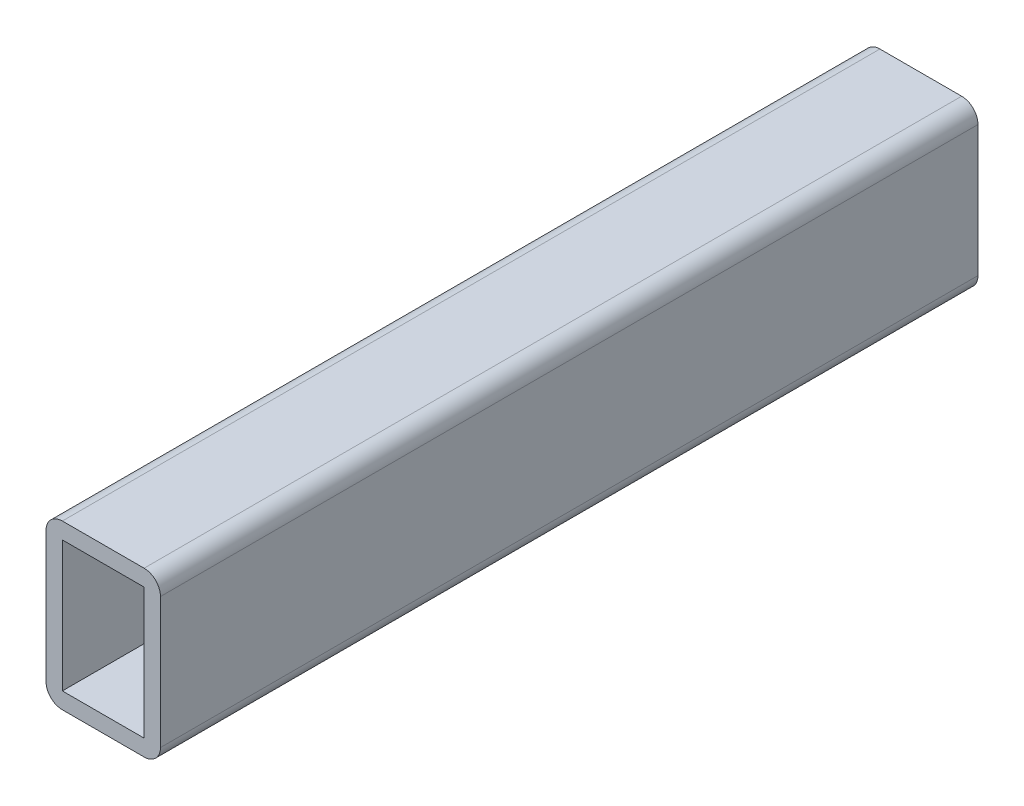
from build123d import *

# Parameters (mm, degrees)
SKETCH1_W          = 7
SKETCH1_H          = 10
EXTRUDE1_DEPTH     = 25
SKETCH2_W          = 5
SKETCH2_H          = 8
CUT_EXTRUDE1_DEPTH = 50
FILLET1_R          = 1
SKETCH3_R          = 1.5
CUT_EXTRUDE2_DEPTH = 1


with BuildPart() as part:
    # Sketch1 → Extrude1 (new, symmetric)
    with BuildSketch(Plane.XY):
        Rectangle(SKETCH1_W, SKETCH1_H)
    extrude(amount=EXTRUDE1_DEPTH, both=True)

    # Sketch2 → Cut-Extrude1 (cut, symmetric)
    with BuildSketch(Plane.XY):
        Rectangle(SKETCH2_W, SKETCH2_H)
    extrude(amount=CUT_EXTRUDE1_DEPTH, both=True, mode=Mode.SUBTRACT)

    # Fillet1
    fillet1_edges = [part.edges().sort_by_distance(p)[0] for p in [
        (3.5, -5, 0),
        (-3.5, -5, 0),
        (3.5, 5, 0),
        (-3.5, 5, 0),
    ]]
    fillet(fillet1_edges, radius=FILLET1_R)

    # Sketch3 → Cut-Extrude2 (cut)
    with BuildSketch(Plane.ZY.offset(3.5)):
        with Locations((-16.5, 0)):
            Circle(SKETCH3_R)
        with Locations(Location((16.5, 0, 0), (0, 0, 180))):
            Circle(SKETCH3_R)
    extrude(amount=-CUT_EXTRUDE2_DEPTH, mode=Mode.SUBTRACT)


solid = part.part
